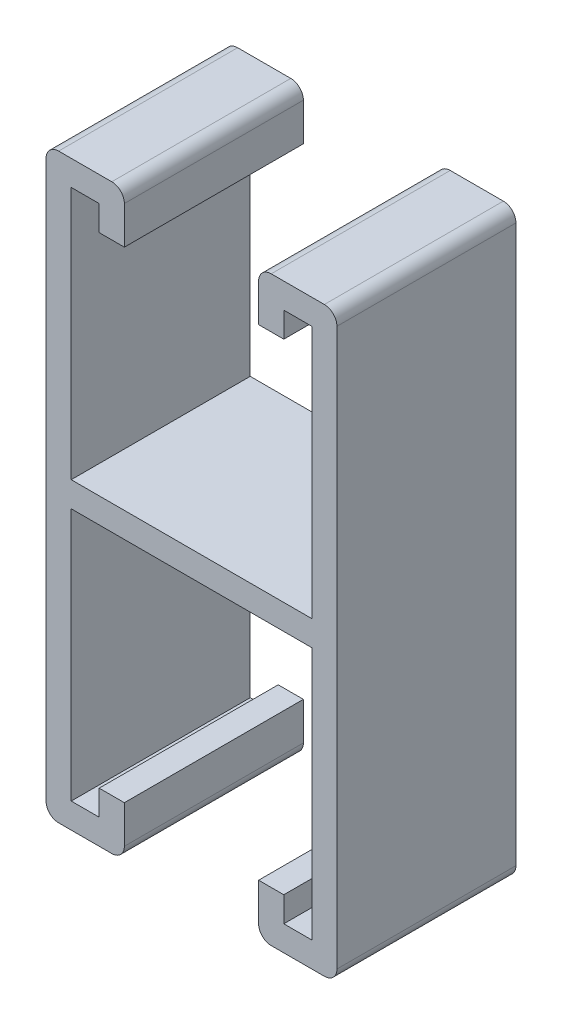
ISO-10303-21;
HEADER;
FILE_DESCRIPTION(('STEP AP214'),'2;1');
FILE_NAME('part.step','',(''),(''),'','','');
FILE_SCHEMA(('AUTOMOTIVE_DESIGN { 1 0 10303 214 1 1 1 1 }'));
ENDSEC;
DATA;
#1=APPLICATION_CONTEXT('core data for automotive mechanical design processes');
#2=APPLICATION_PROTOCOL_DEFINITION('international standard','automotive_design',2000,#1);
#3=PRODUCT_CONTEXT('',#1,'mechanical');
#4=PRODUCT('Part','Part','',(#3));
#5=PRODUCT_RELATED_PRODUCT_CATEGORY('part','',(#4));
#6=PRODUCT_DEFINITION_FORMATION('','',#4);
#7=PRODUCT_DEFINITION_CONTEXT('part definition',#1,'design');
#8=PRODUCT_DEFINITION('design','',#6,#7);
#9=PRODUCT_DEFINITION_SHAPE('','',#8);
#10=(LENGTH_UNIT() NAMED_UNIT(*) SI_UNIT(.MILLI.,.METRE.));
#11=(NAMED_UNIT(*) PLANE_ANGLE_UNIT() SI_UNIT($,.RADIAN.));
#12=(NAMED_UNIT(*) SI_UNIT($,.STERADIAN.) SOLID_ANGLE_UNIT());
#13=UNCERTAINTY_MEASURE_WITH_UNIT(LENGTH_MEASURE(1.E-05),#10,'distance_accuracy_value','');
#14=(GEOMETRIC_REPRESENTATION_CONTEXT(3) GLOBAL_UNCERTAINTY_ASSIGNED_CONTEXT((#13)) GLOBAL_UNIT_ASSIGNED_CONTEXT((#10,
#11,#12)) REPRESENTATION_CONTEXT('',''));
#15=CARTESIAN_POINT('',(0.,0.,0.));
#16=DIRECTION('',(0.,0.,1.));
#17=DIRECTION('',(1.,0.,0.));
#18=AXIS2_PLACEMENT_3D('',#15,#16,#17);
#19=CARTESIAN_POINT('',(9.525,34.13125,12.7));
#20=DIRECTION('',(0.,1.,0.));
#21=DIRECTION('',(0.,0.,1.));
#22=AXIS2_PLACEMENT_3D('',#19,#20,#21);
#23=PLANE('',#22);
#24=DIRECTION('',(1.,0.,0.));
#25=VECTOR('',#24,1.);
#26=CARTESIAN_POINT('',(9.525,34.13125,-12.7));
#27=LINE('',#26,#25);
#28=CARTESIAN_POINT('',(9.525,34.13125,-12.7));
#29=VERTEX_POINT('',#28);
#30=CARTESIAN_POINT('',(13.096875,34.13125,-12.7));
#31=VERTEX_POINT('',#30);
#32=EDGE_CURVE('E297',#29,#31,#27,.T.);
#33=ORIENTED_EDGE('',*,*,#32,.T.);
#34=DIRECTION('',(0.,0.,-1.));
#35=VECTOR('',#34,1.);
#36=CARTESIAN_POINT('',(13.096875,34.13125,12.7));
#37=LINE('',#36,#35);
#38=CARTESIAN_POINT('',(13.096875,34.13125,12.7));
#39=VERTEX_POINT('',#38);
#40=EDGE_CURVE('E11',#39,#31,#37,.T.);
#41=ORIENTED_EDGE('',*,*,#40,.F.);
#42=DIRECTION('',(1.,0.,0.));
#43=VECTOR('',#42,1.);
#44=CARTESIAN_POINT('',(9.525,34.13125,12.7));
#45=LINE('',#44,#43);
#46=CARTESIAN_POINT('',(9.525,34.13125,12.7));
#47=VERTEX_POINT('',#46);
#48=EDGE_CURVE('E367',#47,#39,#45,.T.);
#49=ORIENTED_EDGE('',*,*,#48,.F.);
#50=DIRECTION('',(0.,0.,-1.));
#51=VECTOR('',#50,1.);
#52=CARTESIAN_POINT('',(9.525,34.13125,12.7));
#53=LINE('',#52,#51);
#54=EDGE_CURVE('E293',#47,#29,#53,.T.);
#55=ORIENTED_EDGE('',*,*,#54,.T.);
#56=EDGE_LOOP('',(#33,#41,#49,#55));
#57=FACE_BOUND('',#56,.T.);
#58=ADVANCED_FACE('F33',(#57),#23,.F.);
#59=CARTESIAN_POINT('',(13.096875,37.703125,12.7));
#60=DIRECTION('',(-1.,0.,0.));
#61=DIRECTION('',(0.,0.,1.));
#62=AXIS2_PLACEMENT_3D('',#59,#60,#61);
#63=PLANE('',#62);
#64=DIRECTION('',(0.,1.,0.));
#65=VECTOR('',#64,1.);
#66=CARTESIAN_POINT('',(13.096875,37.703125,-12.7));
#67=LINE('',#66,#65);
#68=CARTESIAN_POINT('',(13.096875,37.703125,-12.7));
#69=VERTEX_POINT('',#68);
#70=EDGE_CURVE('E300',#31,#69,#67,.T.);
#71=ORIENTED_EDGE('',*,*,#70,.T.);
#72=DIRECTION('',(0.,0.,-1.));
#73=VECTOR('',#72,1.);
#74=CARTESIAN_POINT('',(13.096875,37.703125,12.7));
#75=LINE('',#74,#73);
#76=CARTESIAN_POINT('',(13.096875,37.703125,12.7));
#77=VERTEX_POINT('',#76);
#78=EDGE_CURVE('E41',#77,#69,#75,.T.);
#79=ORIENTED_EDGE('',*,*,#78,.F.);
#80=DIRECTION('',(0.,1.,0.));
#81=VECTOR('',#80,1.);
#82=CARTESIAN_POINT('',(13.096875,37.703125,12.7));
#83=LINE('',#82,#81);
#84=EDGE_CURVE('E176',#39,#77,#83,.T.);
#85=ORIENTED_EDGE('',*,*,#84,.F.);
#86=ORIENTED_EDGE('',*,*,#40,.T.);
#87=EDGE_LOOP('',(#71,#79,#85,#86));
#88=FACE_BOUND('',#87,.T.);
#89=ADVANCED_FACE('F565',(#88),#63,.F.);
#90=CARTESIAN_POINT('',(17.065625,37.703125,12.7));
#91=DIRECTION('',(0.,1.,0.));
#92=DIRECTION('',(0.,0.,1.));
#93=AXIS2_PLACEMENT_3D('',#90,#91,#92);
#94=PLANE('',#93);
#95=DIRECTION('',(1.,0.,0.));
#96=VECTOR('',#95,1.);
#97=CARTESIAN_POINT('',(17.065625,37.703125,-12.7));
#98=LINE('',#97,#96);
#99=CARTESIAN_POINT('',(17.065625,37.703125,-12.7));
#100=VERTEX_POINT('',#99);
#101=EDGE_CURVE('E302',#69,#100,#98,.T.);
#102=ORIENTED_EDGE('',*,*,#101,.T.);
#103=DIRECTION('',(0.,0.,-1.));
#104=VECTOR('',#103,1.);
#105=CARTESIAN_POINT('',(17.065625,37.703125,12.7));
#106=LINE('',#105,#104);
#107=CARTESIAN_POINT('',(17.065625,37.703125,12.7));
#108=VERTEX_POINT('',#107);
#109=EDGE_CURVE('E458',#108,#100,#106,.T.);
#110=ORIENTED_EDGE('',*,*,#109,.F.);
#111=DIRECTION('',(1.,0.,0.));
#112=VECTOR('',#111,1.);
#113=CARTESIAN_POINT('',(17.065625,37.703125,12.7));
#114=LINE('',#113,#112);
#115=EDGE_CURVE('E466',#77,#108,#114,.T.);
#116=ORIENTED_EDGE('',*,*,#115,.F.);
#117=ORIENTED_EDGE('',*,*,#78,.T.);
#118=EDGE_LOOP('',(#102,#110,#116,#117));
#119=FACE_BOUND('',#118,.T.);
#120=ADVANCED_FACE('F464',(#119),#94,.F.);
#121=CARTESIAN_POINT('',(17.065625,1.7859375,12.7));
#122=DIRECTION('',(1.,0.,0.));
#123=DIRECTION('',(0.,1.,0.));
#124=AXIS2_PLACEMENT_3D('',#121,#122,#123);
#125=PLANE('',#124);
#126=DIRECTION('',(0.,-1.,0.));
#127=VECTOR('',#126,1.);
#128=CARTESIAN_POINT('',(17.065625,1.7859375,-12.7));
#129=LINE('',#128,#127);
#130=CARTESIAN_POINT('',(17.065625,1.7859375,-12.7));
#131=VERTEX_POINT('',#130);
#132=EDGE_CURVE('E304',#100,#131,#129,.T.);
#133=ORIENTED_EDGE('',*,*,#132,.T.);
#134=DIRECTION('',(0.,0.,-1.));
#135=VECTOR('',#134,1.);
#136=CARTESIAN_POINT('',(17.065625,1.7859375,12.7));
#137=LINE('',#136,#135);
#138=CARTESIAN_POINT('',(17.065625,1.7859375,12.7));
#139=VERTEX_POINT('',#138);
#140=EDGE_CURVE('E455',#139,#131,#137,.T.);
#141=ORIENTED_EDGE('',*,*,#140,.F.);
#142=DIRECTION('',(0.,-1.,0.));
#143=VECTOR('',#142,1.);
#144=CARTESIAN_POINT('',(17.065625,1.7859375,12.7));
#145=LINE('',#144,#143);
#146=EDGE_CURVE('E484',#108,#139,#145,.T.);
#147=ORIENTED_EDGE('',*,*,#146,.F.);
#148=ORIENTED_EDGE('',*,*,#109,.T.);
#149=EDGE_LOOP('',(#133,#141,#147,#148));
#150=FACE_BOUND('',#149,.T.);
#151=ADVANCED_FACE('F475',(#150),#125,.F.);
#152=CARTESIAN_POINT('',(-17.065625,1.78593749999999,12.7));
#153=DIRECTION('',(0.,-1.,0.));
#154=DIRECTION('',(1.,0.,0.));
#155=AXIS2_PLACEMENT_3D('',#152,#153,#154);
#156=PLANE('',#155);
#157=DIRECTION('',(-1.,0.,0.));
#158=VECTOR('',#157,1.);
#159=CARTESIAN_POINT('',(-17.065625,1.78593749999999,-12.7));
#160=LINE('',#159,#158);
#161=CARTESIAN_POINT('',(-17.065625,1.78593749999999,-12.7));
#162=VERTEX_POINT('',#161);
#163=EDGE_CURVE('E306',#131,#162,#160,.T.);
#164=ORIENTED_EDGE('',*,*,#163,.T.);
#165=DIRECTION('',(0.,0.,-1.));
#166=VECTOR('',#165,1.);
#167=CARTESIAN_POINT('',(-17.065625,1.78593749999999,12.7));
#168=LINE('',#167,#166);
#169=CARTESIAN_POINT('',(-17.065625,1.78593749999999,12.7));
#170=VERTEX_POINT('',#169);
#171=EDGE_CURVE('E452',#170,#162,#168,.T.);
#172=ORIENTED_EDGE('',*,*,#171,.F.);
#173=DIRECTION('',(-1.,0.,0.));
#174=VECTOR('',#173,1.);
#175=CARTESIAN_POINT('',(-17.065625,1.78593749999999,12.7));
#176=LINE('',#175,#174);
#177=EDGE_CURVE('E481',#139,#170,#176,.T.);
#178=ORIENTED_EDGE('',*,*,#177,.F.);
#179=ORIENTED_EDGE('',*,*,#140,.T.);
#180=EDGE_LOOP('',(#164,#172,#178,#179));
#181=FACE_BOUND('',#180,.T.);
#182=ADVANCED_FACE('F479',(#181),#156,.F.);
#183=CARTESIAN_POINT('',(-17.065625,37.703125,12.7));
#184=DIRECTION('',(-1.,0.,0.));
#185=DIRECTION('',(0.,-1.,0.));
#186=AXIS2_PLACEMENT_3D('',#183,#184,#185);
#187=PLANE('',#186);
#188=DIRECTION('',(0.,1.,0.));
#189=VECTOR('',#188,1.);
#190=CARTESIAN_POINT('',(-17.065625,37.703125,-12.7));
#191=LINE('',#190,#189);
#192=CARTESIAN_POINT('',(-17.065625,37.703125,-12.7));
#193=VERTEX_POINT('',#192);
#194=EDGE_CURVE('E308',#162,#193,#191,.T.);
#195=ORIENTED_EDGE('',*,*,#194,.T.);
#196=DIRECTION('',(0.,0.,-1.));
#197=VECTOR('',#196,1.);
#198=CARTESIAN_POINT('',(-17.065625,37.703125,12.7));
#199=LINE('',#198,#197);
#200=CARTESIAN_POINT('',(-17.065625,37.703125,12.7));
#201=VERTEX_POINT('',#200);
#202=EDGE_CURVE('E449',#201,#193,#199,.T.);
#203=ORIENTED_EDGE('',*,*,#202,.F.);
#204=DIRECTION('',(0.,1.,0.));
#205=VECTOR('',#204,1.);
#206=CARTESIAN_POINT('',(-17.065625,37.703125,12.7));
#207=LINE('',#206,#205);
#208=EDGE_CURVE('E483',#170,#201,#207,.T.);
#209=ORIENTED_EDGE('',*,*,#208,.F.);
#210=ORIENTED_EDGE('',*,*,#171,.T.);
#211=EDGE_LOOP('',(#195,#203,#209,#210));
#212=FACE_BOUND('',#211,.T.);
#213=ADVANCED_FACE('F578',(#212),#187,.F.);
#214=CARTESIAN_POINT('',(-13.096875,37.703125,12.7));
#215=DIRECTION('',(0.,1.,0.));
#216=DIRECTION('',(0.,0.,1.));
#217=AXIS2_PLACEMENT_3D('',#214,#215,#216);
#218=PLANE('',#217);
#219=DIRECTION('',(1.,0.,0.));
#220=VECTOR('',#219,1.);
#221=CARTESIAN_POINT('',(-13.096875,37.703125,-12.7));
#222=LINE('',#221,#220);
#223=CARTESIAN_POINT('',(-13.096875,37.703125,-12.7));
#224=VERTEX_POINT('',#223);
#225=EDGE_CURVE('E310',#193,#224,#222,.T.);
#226=ORIENTED_EDGE('',*,*,#225,.T.);
#227=DIRECTION('',(0.,0.,-1.));
#228=VECTOR('',#227,1.);
#229=CARTESIAN_POINT('',(-13.096875,37.703125,12.7));
#230=LINE('',#229,#228);
#231=CARTESIAN_POINT('',(-13.096875,37.703125,12.7));
#232=VERTEX_POINT('',#231);
#233=EDGE_CURVE('E446',#232,#224,#230,.T.);
#234=ORIENTED_EDGE('',*,*,#233,.F.);
#235=DIRECTION('',(1.,0.,0.));
#236=VECTOR('',#235,1.);
#237=CARTESIAN_POINT('',(-13.096875,37.703125,12.7));
#238=LINE('',#237,#236);
#239=EDGE_CURVE('E486',#201,#232,#238,.T.);
#240=ORIENTED_EDGE('',*,*,#239,.F.);
#241=ORIENTED_EDGE('',*,*,#202,.T.);
#242=EDGE_LOOP('',(#226,#234,#240,#241));
#243=FACE_BOUND('',#242,.T.);
#244=ADVANCED_FACE('F581',(#243),#218,.F.);
#245=CARTESIAN_POINT('',(-13.096875,37.703125,12.7));
#246=DIRECTION('',(1.,0.,0.));
#247=DIRECTION('',(0.,0.,-1.));
#248=AXIS2_PLACEMENT_3D('',#245,#246,#247);
#249=PLANE('',#248);
#250=DIRECTION('',(0.,-1.,0.));
#251=VECTOR('',#250,1.);
#252=CARTESIAN_POINT('',(-13.096875,37.703125,-12.7));
#253=LINE('',#252,#251);
#254=CARTESIAN_POINT('',(-13.096875,34.13125,-12.7));
#255=VERTEX_POINT('',#254);
#256=EDGE_CURVE('E312',#224,#255,#253,.T.);
#257=ORIENTED_EDGE('',*,*,#256,.T.);
#258=DIRECTION('',(0.,0.,-1.));
#259=VECTOR('',#258,1.);
#260=CARTESIAN_POINT('',(-13.096875,34.13125,12.7));
#261=LINE('',#260,#259);
#262=CARTESIAN_POINT('',(-13.096875,34.13125,12.7));
#263=VERTEX_POINT('',#262);
#264=EDGE_CURVE('E443',#263,#255,#261,.T.);
#265=ORIENTED_EDGE('',*,*,#264,.F.);
#266=DIRECTION('',(0.,-1.,0.));
#267=VECTOR('',#266,1.);
#268=CARTESIAN_POINT('',(-13.096875,37.703125,12.7));
#269=LINE('',#268,#267);
#270=EDGE_CURVE('E492',#232,#263,#269,.T.);
#271=ORIENTED_EDGE('',*,*,#270,.F.);
#272=ORIENTED_EDGE('',*,*,#233,.T.);
#273=EDGE_LOOP('',(#257,#265,#271,#272));
#274=FACE_BOUND('',#273,.T.);
#275=ADVANCED_FACE('F585',(#274),#249,.F.);
#276=CARTESIAN_POINT('',(-13.096875,34.13125,12.7));
#277=DIRECTION('',(0.,1.,0.));
#278=DIRECTION('',(0.,0.,1.));
#279=AXIS2_PLACEMENT_3D('',#276,#277,#278);
#280=PLANE('',#279);
#281=DIRECTION('',(1.,0.,0.));
#282=VECTOR('',#281,1.);
#283=CARTESIAN_POINT('',(-13.096875,34.13125,-12.7));
#284=LINE('',#283,#282);
#285=CARTESIAN_POINT('',(-9.52500000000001,34.13125,-12.7));
#286=VERTEX_POINT('',#285);
#287=EDGE_CURVE('E314',#255,#286,#284,.T.);
#288=ORIENTED_EDGE('',*,*,#287,.T.);
#289=DIRECTION('',(0.,0.,-1.));
#290=VECTOR('',#289,1.);
#291=CARTESIAN_POINT('',(-9.52500000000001,34.13125,12.7));
#292=LINE('',#291,#290);
#293=CARTESIAN_POINT('',(-9.52500000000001,34.13125,12.7));
#294=VERTEX_POINT('',#293);
#295=EDGE_CURVE('E440',#294,#286,#292,.T.);
#296=ORIENTED_EDGE('',*,*,#295,.F.);
#297=DIRECTION('',(1.,0.,0.));
#298=VECTOR('',#297,1.);
#299=CARTESIAN_POINT('',(-13.096875,34.13125,12.7));
#300=LINE('',#299,#298);
#301=EDGE_CURVE('E494',#263,#294,#300,.T.);
#302=ORIENTED_EDGE('',*,*,#301,.F.);
#303=ORIENTED_EDGE('',*,*,#264,.T.);
#304=EDGE_LOOP('',(#288,#296,#302,#303));
#305=FACE_BOUND('',#304,.T.);
#306=ADVANCED_FACE('F589',(#305),#280,.F.);
#307=CARTESIAN_POINT('',(-9.52500000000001,39.4890625,12.7));
#308=DIRECTION('',(-1.,0.,0.));
#309=DIRECTION('',(0.,-1.,0.));
#310=AXIS2_PLACEMENT_3D('',#307,#308,#309);
#311=PLANE('',#310);
#312=DIRECTION('',(0.,1.,0.));
#313=VECTOR('',#312,1.);
#314=CARTESIAN_POINT('',(-9.52500000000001,39.4890625,-12.7));
#315=LINE('',#314,#313);
#316=CARTESIAN_POINT('',(-9.52500000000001,39.4890625,-12.7));
#317=VERTEX_POINT('',#316);
#318=EDGE_CURVE('E316',#286,#317,#315,.T.);
#319=ORIENTED_EDGE('',*,*,#318,.T.);
#320=DIRECTION('',(0.,0.,-1.));
#321=VECTOR('',#320,1.);
#322=CARTESIAN_POINT('',(-9.52500000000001,39.4890625,12.7));
#323=LINE('',#322,#321);
#324=CARTESIAN_POINT('',(-9.52500000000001,39.4890625,12.7));
#325=VERTEX_POINT('',#324);
#326=EDGE_CURVE('E437',#325,#317,#323,.T.);
#327=ORIENTED_EDGE('',*,*,#326,.F.);
#328=DIRECTION('',(0.,1.,0.));
#329=VECTOR('',#328,1.);
#330=CARTESIAN_POINT('',(-9.52500000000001,39.4890625,12.7));
#331=LINE('',#330,#329);
#332=EDGE_CURVE('E496',#294,#325,#331,.T.);
#333=ORIENTED_EDGE('',*,*,#332,.F.);
#334=ORIENTED_EDGE('',*,*,#295,.T.);
#335=EDGE_LOOP('',(#319,#327,#333,#334));
#336=FACE_BOUND('',#335,.T.);
#337=ADVANCED_FACE('F593',(#336),#311,.F.);
#338=CARTESIAN_POINT('',(-11.3109375,39.4890625,12.7));
#339=DIRECTION('',(0.,0.,-1.));
#340=DIRECTION('',(-1.,0.,0.));
#341=AXIS2_PLACEMENT_3D('',#338,#339,#340);
#342=CYLINDRICAL_SURFACE('',#341,1.7859375);
#343=CARTESIAN_POINT('',(-11.3109375,39.4890625,-12.7));
#344=DIRECTION('',(0.,0.,1.));
#345=DIRECTION('',(-1.,0.,0.));
#346=AXIS2_PLACEMENT_3D('',#343,#344,#345);
#347=CIRCLE('',#346,1.7859375);
#348=CARTESIAN_POINT('',(-11.3109375,41.275,-12.7));
#349=VERTEX_POINT('',#348);
#350=EDGE_CURVE('E318',#317,#349,#347,.T.);
#351=ORIENTED_EDGE('',*,*,#350,.T.);
#352=DIRECTION('',(0.,0.,-1.));
#353=VECTOR('',#352,1.);
#354=CARTESIAN_POINT('',(-11.3109375,41.275,12.7));
#355=LINE('',#354,#353);
#356=CARTESIAN_POINT('',(-11.3109375,41.275,12.7));
#357=VERTEX_POINT('',#356);
#358=EDGE_CURVE('E434',#357,#349,#355,.T.);
#359=ORIENTED_EDGE('',*,*,#358,.F.);
#360=CARTESIAN_POINT('',(-11.3109375,39.4890625,12.7));
#361=DIRECTION('',(0.,0.,1.));
#362=DIRECTION('',(-1.,0.,0.));
#363=AXIS2_PLACEMENT_3D('',#360,#361,#362);
#364=CIRCLE('',#363,1.7859375);
#365=EDGE_CURVE('E498',#325,#357,#364,.T.);
#366=ORIENTED_EDGE('',*,*,#365,.F.);
#367=ORIENTED_EDGE('',*,*,#326,.T.);
#368=EDGE_LOOP('',(#351,#359,#366,#367));
#369=FACE_BOUND('',#368,.T.);
#370=ADVANCED_FACE('F597',(#369),#342,.T.);
#371=CARTESIAN_POINT('',(-11.3109375,41.275,12.7));
#372=DIRECTION('',(0.,-1.,0.));
#373=DIRECTION('',(1.,0.,0.));
#374=AXIS2_PLACEMENT_3D('',#371,#372,#373);
#375=PLANE('',#374);
#376=DIRECTION('',(-1.,0.,0.));
#377=VECTOR('',#376,1.);
#378=CARTESIAN_POINT('',(-11.3109375,41.275,-12.7));
#379=LINE('',#378,#377);
#380=CARTESIAN_POINT('',(-18.8515625,41.275,-12.7));
#381=VERTEX_POINT('',#380);
#382=EDGE_CURVE('E320',#349,#381,#379,.T.);
#383=ORIENTED_EDGE('',*,*,#382,.T.);
#384=DIRECTION('',(0.,0.,-1.));
#385=VECTOR('',#384,1.);
#386=CARTESIAN_POINT('',(-18.8515625,41.275,12.7));
#387=LINE('',#386,#385);
#388=CARTESIAN_POINT('',(-18.8515625,41.275,12.7));
#389=VERTEX_POINT('',#388);
#390=EDGE_CURVE('E431',#389,#381,#387,.T.);
#391=ORIENTED_EDGE('',*,*,#390,.F.);
#392=DIRECTION('',(-1.,0.,0.));
#393=VECTOR('',#392,1.);
#394=CARTESIAN_POINT('',(-11.3109375,41.275,12.7));
#395=LINE('',#394,#393);
#396=EDGE_CURVE('E500',#357,#389,#395,.T.);
#397=ORIENTED_EDGE('',*,*,#396,.F.);
#398=ORIENTED_EDGE('',*,*,#358,.T.);
#399=EDGE_LOOP('',(#383,#391,#397,#398));
#400=FACE_BOUND('',#399,.T.);
#401=ADVANCED_FACE('F601',(#400),#375,.F.);
#402=CARTESIAN_POINT('',(-18.8515625,39.4890625,12.7));
#403=DIRECTION('',(0.,0.,-1.));
#404=DIRECTION('',(-1.,0.,0.));
#405=AXIS2_PLACEMENT_3D('',#402,#403,#404);
#406=CYLINDRICAL_SURFACE('',#405,1.78593750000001);
#407=CARTESIAN_POINT('',(-18.8515625,39.4890625,-12.7));
#408=DIRECTION('',(0.,0.,1.));
#409=DIRECTION('',(-1.,0.,0.));
#410=AXIS2_PLACEMENT_3D('',#407,#408,#409);
#411=CIRCLE('',#410,1.78593750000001);
#412=CARTESIAN_POINT('',(-20.6375,39.4890625,-12.7));
#413=VERTEX_POINT('',#412);
#414=EDGE_CURVE('E322',#381,#413,#411,.T.);
#415=ORIENTED_EDGE('',*,*,#414,.T.);
#416=DIRECTION('',(0.,0.,-1.));
#417=VECTOR('',#416,1.);
#418=CARTESIAN_POINT('',(-20.6375,39.4890625,12.7));
#419=LINE('',#418,#417);
#420=CARTESIAN_POINT('',(-20.6375,39.4890625,12.7));
#421=VERTEX_POINT('',#420);
#422=EDGE_CURVE('E428',#421,#413,#419,.T.);
#423=ORIENTED_EDGE('',*,*,#422,.F.);
#424=CARTESIAN_POINT('',(-18.8515625,39.4890625,12.7));
#425=DIRECTION('',(0.,0.,1.));
#426=DIRECTION('',(-1.,0.,0.));
#427=AXIS2_PLACEMENT_3D('',#424,#425,#426);
#428=CIRCLE('',#427,1.78593750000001);
#429=EDGE_CURVE('E502',#389,#421,#428,.T.);
#430=ORIENTED_EDGE('',*,*,#429,.F.);
#431=ORIENTED_EDGE('',*,*,#390,.T.);
#432=EDGE_LOOP('',(#415,#423,#430,#431));
#433=FACE_BOUND('',#432,.T.);
#434=ADVANCED_FACE('F605',(#433),#406,.T.);
#435=CARTESIAN_POINT('',(-20.6375,39.4890625,12.7));
#436=DIRECTION('',(1.,0.,0.));
#437=DIRECTION('',(0.,1.,0.));
#438=AXIS2_PLACEMENT_3D('',#435,#436,#437);
#439=PLANE('',#438);
#440=DIRECTION('',(0.,-1.,0.));
#441=VECTOR('',#440,1.);
#442=CARTESIAN_POINT('',(-20.6375,39.4890625,-12.7));
#443=LINE('',#442,#441);
#444=CARTESIAN_POINT('',(-20.6375,-39.4890625,-12.7));
#445=VERTEX_POINT('',#444);
#446=EDGE_CURVE('E324',#413,#445,#443,.T.);
#447=ORIENTED_EDGE('',*,*,#446,.T.);
#448=DIRECTION('',(0.,0.,-1.));
#449=VECTOR('',#448,1.);
#450=CARTESIAN_POINT('',(-20.6375,-39.4890625,12.7));
#451=LINE('',#450,#449);
#452=CARTESIAN_POINT('',(-20.6375,-39.4890625,12.7));
#453=VERTEX_POINT('',#452);
#454=EDGE_CURVE('E425',#453,#445,#451,.T.);
#455=ORIENTED_EDGE('',*,*,#454,.F.);
#456=DIRECTION('',(0.,-1.,0.));
#457=VECTOR('',#456,1.);
#458=CARTESIAN_POINT('',(-20.6375,39.4890625,12.7));
#459=LINE('',#458,#457);
#460=EDGE_CURVE('E504',#421,#453,#459,.T.);
#461=ORIENTED_EDGE('',*,*,#460,.F.);
#462=ORIENTED_EDGE('',*,*,#422,.T.);
#463=EDGE_LOOP('',(#447,#455,#461,#462));
#464=FACE_BOUND('',#463,.T.);
#465=ADVANCED_FACE('F609',(#464),#439,.F.);
#466=CARTESIAN_POINT('',(-18.8515625,-39.4890625,12.7));
#467=DIRECTION('',(0.,0.,-1.));
#468=DIRECTION('',(-1.,0.,0.));
#469=AXIS2_PLACEMENT_3D('',#466,#467,#468);
#470=CYLINDRICAL_SURFACE('',#469,1.78593750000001);
#471=CARTESIAN_POINT('',(-18.8515625,-39.4890625,-12.7));
#472=DIRECTION('',(0.,0.,1.));
#473=DIRECTION('',(1.,0.,0.));
#474=AXIS2_PLACEMENT_3D('',#471,#472,#473);
#475=CIRCLE('',#474,1.78593750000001);
#476=CARTESIAN_POINT('',(-18.8515625,-41.275,-12.7));
#477=VERTEX_POINT('',#476);
#478=EDGE_CURVE('E326',#445,#477,#475,.T.);
#479=ORIENTED_EDGE('',*,*,#478,.T.);
#480=DIRECTION('',(0.,0.,-1.));
#481=VECTOR('',#480,1.);
#482=CARTESIAN_POINT('',(-18.8515625,-41.275,12.7));
#483=LINE('',#482,#481);
#484=CARTESIAN_POINT('',(-18.8515625,-41.275,12.7));
#485=VERTEX_POINT('',#484);
#486=EDGE_CURVE('E422',#485,#477,#483,.T.);
#487=ORIENTED_EDGE('',*,*,#486,.F.);
#488=CARTESIAN_POINT('',(-18.8515625,-39.4890625,12.7));
#489=DIRECTION('',(0.,0.,1.));
#490=DIRECTION('',(1.,0.,0.));
#491=AXIS2_PLACEMENT_3D('',#488,#489,#490);
#492=CIRCLE('',#491,1.78593750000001);
#493=EDGE_CURVE('E506',#453,#485,#492,.T.);
#494=ORIENTED_EDGE('',*,*,#493,.F.);
#495=ORIENTED_EDGE('',*,*,#454,.T.);
#496=EDGE_LOOP('',(#479,#487,#494,#495));
#497=FACE_BOUND('',#496,.T.);
#498=ADVANCED_FACE('F613',(#497),#470,.T.);
#499=CARTESIAN_POINT('',(-11.3109375,-41.275,12.7));
#500=DIRECTION('',(0.,1.,0.));
#501=DIRECTION('',(-1.,0.,0.));
#502=AXIS2_PLACEMENT_3D('',#499,#500,#501);
#503=PLANE('',#502);
#504=DIRECTION('',(1.,0.,0.));
#505=VECTOR('',#504,1.);
#506=CARTESIAN_POINT('',(-11.3109375,-41.275,-12.7));
#507=LINE('',#506,#505);
#508=CARTESIAN_POINT('',(-11.3109375,-41.275,-12.7));
#509=VERTEX_POINT('',#508);
#510=EDGE_CURVE('E328',#477,#509,#507,.T.);
#511=ORIENTED_EDGE('',*,*,#510,.T.);
#512=DIRECTION('',(0.,0.,-1.));
#513=VECTOR('',#512,1.);
#514=CARTESIAN_POINT('',(-11.3109375,-41.275,12.7));
#515=LINE('',#514,#513);
#516=CARTESIAN_POINT('',(-11.3109375,-41.275,12.7));
#517=VERTEX_POINT('',#516);
#518=EDGE_CURVE('E419',#517,#509,#515,.T.);
#519=ORIENTED_EDGE('',*,*,#518,.F.);
#520=DIRECTION('',(1.,0.,0.));
#521=VECTOR('',#520,1.);
#522=CARTESIAN_POINT('',(-11.3109375,-41.275,12.7));
#523=LINE('',#522,#521);
#524=EDGE_CURVE('E508',#485,#517,#523,.T.);
#525=ORIENTED_EDGE('',*,*,#524,.F.);
#526=ORIENTED_EDGE('',*,*,#486,.T.);
#527=EDGE_LOOP('',(#511,#519,#525,#526));
#528=FACE_BOUND('',#527,.T.);
#529=ADVANCED_FACE('F617',(#528),#503,.F.);
#530=CARTESIAN_POINT('',(-11.3109375,-39.4890625,12.7));
#531=DIRECTION('',(0.,0.,-1.));
#532=DIRECTION('',(-1.,0.,0.));
#533=AXIS2_PLACEMENT_3D('',#530,#531,#532);
#534=CYLINDRICAL_SURFACE('',#533,1.7859375);
#535=CARTESIAN_POINT('',(-11.3109375,-39.4890625,-12.7));
#536=DIRECTION('',(0.,0.,1.));
#537=DIRECTION('',(1.,0.,0.));
#538=AXIS2_PLACEMENT_3D('',#535,#536,#537);
#539=CIRCLE('',#538,1.7859375);
#540=CARTESIAN_POINT('',(-9.525,-39.4890625,-12.7));
#541=VERTEX_POINT('',#540);
#542=EDGE_CURVE('E330',#509,#541,#539,.T.);
#543=ORIENTED_EDGE('',*,*,#542,.T.);
#544=DIRECTION('',(0.,0.,-1.));
#545=VECTOR('',#544,1.);
#546=CARTESIAN_POINT('',(-9.525,-39.4890625,12.7));
#547=LINE('',#546,#545);
#548=CARTESIAN_POINT('',(-9.525,-39.4890625,12.7));
#549=VERTEX_POINT('',#548);
#550=EDGE_CURVE('E416',#549,#541,#547,.T.);
#551=ORIENTED_EDGE('',*,*,#550,.F.);
#552=CARTESIAN_POINT('',(-11.3109375,-39.4890625,12.7));
#553=DIRECTION('',(0.,0.,1.));
#554=DIRECTION('',(1.,0.,0.));
#555=AXIS2_PLACEMENT_3D('',#552,#553,#554);
#556=CIRCLE('',#555,1.7859375);
#557=EDGE_CURVE('E510',#517,#549,#556,.T.);
#558=ORIENTED_EDGE('',*,*,#557,.F.);
#559=ORIENTED_EDGE('',*,*,#518,.T.);
#560=EDGE_LOOP('',(#543,#551,#558,#559));
#561=FACE_BOUND('',#560,.T.);
#562=ADVANCED_FACE('F621',(#561),#534,.T.);
#563=CARTESIAN_POINT('',(-9.525,-39.4890625,12.7));
#564=DIRECTION('',(-1.,0.,0.));
#565=DIRECTION('',(0.,-1.,0.));
#566=AXIS2_PLACEMENT_3D('',#563,#564,#565);
#567=PLANE('',#566);
#568=DIRECTION('',(0.,1.,0.));
#569=VECTOR('',#568,1.);
#570=CARTESIAN_POINT('',(-9.525,-39.4890625,-12.7));
#571=LINE('',#570,#569);
#572=CARTESIAN_POINT('',(-9.525,-34.13125,-12.7));
#573=VERTEX_POINT('',#572);
#574=EDGE_CURVE('E332',#541,#573,#571,.T.);
#575=ORIENTED_EDGE('',*,*,#574,.T.);
#576=DIRECTION('',(0.,0.,-1.));
#577=VECTOR('',#576,1.);
#578=CARTESIAN_POINT('',(-9.525,-34.13125,12.7));
#579=LINE('',#578,#577);
#580=CARTESIAN_POINT('',(-9.525,-34.13125,12.7));
#581=VERTEX_POINT('',#580);
#582=EDGE_CURVE('E413',#581,#573,#579,.T.);
#583=ORIENTED_EDGE('',*,*,#582,.F.);
#584=DIRECTION('',(0.,1.,0.));
#585=VECTOR('',#584,1.);
#586=CARTESIAN_POINT('',(-9.525,-39.4890625,12.7));
#587=LINE('',#586,#585);
#588=EDGE_CURVE('E512',#549,#581,#587,.T.);
#589=ORIENTED_EDGE('',*,*,#588,.F.);
#590=ORIENTED_EDGE('',*,*,#550,.T.);
#591=EDGE_LOOP('',(#575,#583,#589,#590));
#592=FACE_BOUND('',#591,.T.);
#593=ADVANCED_FACE('F625',(#592),#567,.F.);
#594=CARTESIAN_POINT('',(-13.096875,-34.13125,12.7));
#595=DIRECTION('',(0.,-1.,0.));
#596=DIRECTION('',(0.,0.,-1.));
#597=AXIS2_PLACEMENT_3D('',#594,#595,#596);
#598=PLANE('',#597);
#599=DIRECTION('',(-1.,0.,0.));
#600=VECTOR('',#599,1.);
#601=CARTESIAN_POINT('',(-13.096875,-34.13125,-12.7));
#602=LINE('',#601,#600);
#603=CARTESIAN_POINT('',(-13.096875,-34.13125,-12.7));
#604=VERTEX_POINT('',#603);
#605=EDGE_CURVE('E334',#573,#604,#602,.T.);
#606=ORIENTED_EDGE('',*,*,#605,.T.);
#607=DIRECTION('',(0.,0.,-1.));
#608=VECTOR('',#607,1.);
#609=CARTESIAN_POINT('',(-13.096875,-34.13125,12.7));
#610=LINE('',#609,#608);
#611=CARTESIAN_POINT('',(-13.096875,-34.13125,12.7));
#612=VERTEX_POINT('',#611);
#613=EDGE_CURVE('E410',#612,#604,#610,.T.);
#614=ORIENTED_EDGE('',*,*,#613,.F.);
#615=DIRECTION('',(-1.,0.,0.));
#616=VECTOR('',#615,1.);
#617=CARTESIAN_POINT('',(-13.096875,-34.13125,12.7));
#618=LINE('',#617,#616);
#619=EDGE_CURVE('E514',#581,#612,#618,.T.);
#620=ORIENTED_EDGE('',*,*,#619,.F.);
#621=ORIENTED_EDGE('',*,*,#582,.T.);
#622=EDGE_LOOP('',(#606,#614,#620,#621));
#623=FACE_BOUND('',#622,.T.);
#624=ADVANCED_FACE('F629',(#623),#598,.F.);
#625=CARTESIAN_POINT('',(-13.096875,-37.703125,12.7));
#626=DIRECTION('',(1.,0.,0.));
#627=DIRECTION('',(0.,0.,-1.));
#628=AXIS2_PLACEMENT_3D('',#625,#626,#627);
#629=PLANE('',#628);
#630=DIRECTION('',(0.,-1.,0.));
#631=VECTOR('',#630,1.);
#632=CARTESIAN_POINT('',(-13.096875,-37.703125,-12.7));
#633=LINE('',#632,#631);
#634=CARTESIAN_POINT('',(-13.096875,-37.703125,-12.7));
#635=VERTEX_POINT('',#634);
#636=EDGE_CURVE('E336',#604,#635,#633,.T.);
#637=ORIENTED_EDGE('',*,*,#636,.T.);
#638=DIRECTION('',(0.,0.,-1.));
#639=VECTOR('',#638,1.);
#640=CARTESIAN_POINT('',(-13.096875,-37.703125,12.7));
#641=LINE('',#640,#639);
#642=CARTESIAN_POINT('',(-13.096875,-37.703125,12.7));
#643=VERTEX_POINT('',#642);
#644=EDGE_CURVE('E407',#643,#635,#641,.T.);
#645=ORIENTED_EDGE('',*,*,#644,.F.);
#646=DIRECTION('',(0.,-1.,0.));
#647=VECTOR('',#646,1.);
#648=CARTESIAN_POINT('',(-13.096875,-37.703125,12.7));
#649=LINE('',#648,#647);
#650=EDGE_CURVE('E516',#612,#643,#649,.T.);
#651=ORIENTED_EDGE('',*,*,#650,.F.);
#652=ORIENTED_EDGE('',*,*,#613,.T.);
#653=EDGE_LOOP('',(#637,#645,#651,#652));
#654=FACE_BOUND('',#653,.T.);
#655=ADVANCED_FACE('F633',(#654),#629,.F.);
#656=CARTESIAN_POINT('',(-13.096875,-37.703125,12.7));
#657=DIRECTION('',(0.,-1.,0.));
#658=DIRECTION('',(0.,0.,-1.));
#659=AXIS2_PLACEMENT_3D('',#656,#657,#658);
#660=PLANE('',#659);
#661=DIRECTION('',(-1.,0.,0.));
#662=VECTOR('',#661,1.);
#663=CARTESIAN_POINT('',(-13.096875,-37.703125,-12.7));
#664=LINE('',#663,#662);
#665=CARTESIAN_POINT('',(-17.065625,-37.703125,-12.7));
#666=VERTEX_POINT('',#665);
#667=EDGE_CURVE('E338',#635,#666,#664,.T.);
#668=ORIENTED_EDGE('',*,*,#667,.T.);
#669=DIRECTION('',(0.,0.,-1.));
#670=VECTOR('',#669,1.);
#671=CARTESIAN_POINT('',(-17.065625,-37.703125,12.7));
#672=LINE('',#671,#670);
#673=CARTESIAN_POINT('',(-17.065625,-37.703125,12.7));
#674=VERTEX_POINT('',#673);
#675=EDGE_CURVE('E404',#674,#666,#672,.T.);
#676=ORIENTED_EDGE('',*,*,#675,.F.);
#677=DIRECTION('',(-1.,0.,0.));
#678=VECTOR('',#677,1.);
#679=CARTESIAN_POINT('',(-13.096875,-37.703125,12.7));
#680=LINE('',#679,#678);
#681=EDGE_CURVE('E518',#643,#674,#680,.T.);
#682=ORIENTED_EDGE('',*,*,#681,.F.);
#683=ORIENTED_EDGE('',*,*,#644,.T.);
#684=EDGE_LOOP('',(#668,#676,#682,#683));
#685=FACE_BOUND('',#684,.T.);
#686=ADVANCED_FACE('F637',(#685),#660,.F.);
#687=CARTESIAN_POINT('',(-17.065625,-37.703125,12.7));
#688=DIRECTION('',(-1.,0.,0.));
#689=DIRECTION('',(0.,-1.,0.));
#690=AXIS2_PLACEMENT_3D('',#687,#688,#689);
#691=PLANE('',#690);
#692=DIRECTION('',(0.,1.,0.));
#693=VECTOR('',#692,1.);
#694=CARTESIAN_POINT('',(-17.065625,-37.703125,-12.7));
#695=LINE('',#694,#693);
#696=CARTESIAN_POINT('',(-17.065625,-1.7859375,-12.7));
#697=VERTEX_POINT('',#696);
#698=EDGE_CURVE('E340',#666,#697,#695,.T.);
#699=ORIENTED_EDGE('',*,*,#698,.T.);
#700=DIRECTION('',(0.,0.,-1.));
#701=VECTOR('',#700,1.);
#702=CARTESIAN_POINT('',(-17.065625,-1.7859375,12.7));
#703=LINE('',#702,#701);
#704=CARTESIAN_POINT('',(-17.065625,-1.7859375,12.7));
#705=VERTEX_POINT('',#704);
#706=EDGE_CURVE('E401',#705,#697,#703,.T.);
#707=ORIENTED_EDGE('',*,*,#706,.F.);
#708=DIRECTION('',(0.,1.,0.));
#709=VECTOR('',#708,1.);
#710=CARTESIAN_POINT('',(-17.065625,-37.703125,12.7));
#711=LINE('',#710,#709);
#712=EDGE_CURVE('E520',#674,#705,#711,.T.);
#713=ORIENTED_EDGE('',*,*,#712,.F.);
#714=ORIENTED_EDGE('',*,*,#675,.T.);
#715=EDGE_LOOP('',(#699,#707,#713,#714));
#716=FACE_BOUND('',#715,.T.);
#717=ADVANCED_FACE('F641',(#716),#691,.F.);
#718=CARTESIAN_POINT('',(-17.065625,-1.7859375,12.7));
#719=DIRECTION('',(0.,1.,0.));
#720=DIRECTION('',(0.,0.,1.));
#721=AXIS2_PLACEMENT_3D('',#718,#719,#720);
#722=PLANE('',#721);
#723=DIRECTION('',(1.,0.,0.));
#724=VECTOR('',#723,1.);
#725=CARTESIAN_POINT('',(-17.065625,-1.7859375,-12.7));
#726=LINE('',#725,#724);
#727=CARTESIAN_POINT('',(17.065625,-1.7859375,-12.7));
#728=VERTEX_POINT('',#727);
#729=EDGE_CURVE('E342',#697,#728,#726,.T.);
#730=ORIENTED_EDGE('',*,*,#729,.T.);
#731=DIRECTION('',(0.,0.,-1.));
#732=VECTOR('',#731,1.);
#733=CARTESIAN_POINT('',(17.065625,-1.7859375,12.7));
#734=LINE('',#733,#732);
#735=CARTESIAN_POINT('',(17.065625,-1.7859375,12.7));
#736=VERTEX_POINT('',#735);
#737=EDGE_CURVE('E398',#736,#728,#734,.T.);
#738=ORIENTED_EDGE('',*,*,#737,.F.);
#739=DIRECTION('',(1.,0.,0.));
#740=VECTOR('',#739,1.);
#741=CARTESIAN_POINT('',(-17.065625,-1.7859375,12.7));
#742=LINE('',#741,#740);
#743=EDGE_CURVE('E522',#705,#736,#742,.T.);
#744=ORIENTED_EDGE('',*,*,#743,.F.);
#745=ORIENTED_EDGE('',*,*,#706,.T.);
#746=EDGE_LOOP('',(#730,#738,#744,#745));
#747=FACE_BOUND('',#746,.T.);
#748=ADVANCED_FACE('F645',(#747),#722,.F.);
#749=CARTESIAN_POINT('',(17.065625,-1.7859375,12.7));
#750=DIRECTION('',(1.,0.,0.));
#751=DIRECTION('',(0.,1.,0.));
#752=AXIS2_PLACEMENT_3D('',#749,#750,#751);
#753=PLANE('',#752);
#754=DIRECTION('',(0.,-1.,0.));
#755=VECTOR('',#754,1.);
#756=CARTESIAN_POINT('',(17.065625,-1.7859375,-12.7));
#757=LINE('',#756,#755);
#758=CARTESIAN_POINT('',(17.065625,-37.703125,-12.7));
#759=VERTEX_POINT('',#758);
#760=EDGE_CURVE('E344',#728,#759,#757,.T.);
#761=ORIENTED_EDGE('',*,*,#760,.T.);
#762=DIRECTION('',(0.,0.,-1.));
#763=VECTOR('',#762,1.);
#764=CARTESIAN_POINT('',(17.065625,-37.703125,12.7));
#765=LINE('',#764,#763);
#766=CARTESIAN_POINT('',(17.065625,-37.703125,12.7));
#767=VERTEX_POINT('',#766);
#768=EDGE_CURVE('E395',#767,#759,#765,.T.);
#769=ORIENTED_EDGE('',*,*,#768,.F.);
#770=DIRECTION('',(0.,-1.,0.));
#771=VECTOR('',#770,1.);
#772=CARTESIAN_POINT('',(17.065625,-1.7859375,12.7));
#773=LINE('',#772,#771);
#774=EDGE_CURVE('E524',#736,#767,#773,.T.);
#775=ORIENTED_EDGE('',*,*,#774,.F.);
#776=ORIENTED_EDGE('',*,*,#737,.T.);
#777=EDGE_LOOP('',(#761,#769,#775,#776));
#778=FACE_BOUND('',#777,.T.);
#779=ADVANCED_FACE('F649',(#778),#753,.F.);
#780=CARTESIAN_POINT('',(17.065625,-37.703125,12.7));
#781=DIRECTION('',(0.,-1.,0.));
#782=DIRECTION('',(0.,0.,-1.));
#783=AXIS2_PLACEMENT_3D('',#780,#781,#782);
#784=PLANE('',#783);
#785=DIRECTION('',(-1.,0.,0.));
#786=VECTOR('',#785,1.);
#787=CARTESIAN_POINT('',(17.065625,-37.703125,-12.7));
#788=LINE('',#787,#786);
#789=CARTESIAN_POINT('',(13.096875,-37.703125,-12.7));
#790=VERTEX_POINT('',#789);
#791=EDGE_CURVE('E346',#759,#790,#788,.T.);
#792=ORIENTED_EDGE('',*,*,#791,.T.);
#793=DIRECTION('',(0.,0.,-1.));
#794=VECTOR('',#793,1.);
#795=CARTESIAN_POINT('',(13.096875,-37.703125,12.7));
#796=LINE('',#795,#794);
#797=CARTESIAN_POINT('',(13.096875,-37.703125,12.7));
#798=VERTEX_POINT('',#797);
#799=EDGE_CURVE('E392',#798,#790,#796,.T.);
#800=ORIENTED_EDGE('',*,*,#799,.F.);
#801=DIRECTION('',(-1.,0.,0.));
#802=VECTOR('',#801,1.);
#803=CARTESIAN_POINT('',(17.065625,-37.703125,12.7));
#804=LINE('',#803,#802);
#805=EDGE_CURVE('E526',#767,#798,#804,.T.);
#806=ORIENTED_EDGE('',*,*,#805,.F.);
#807=ORIENTED_EDGE('',*,*,#768,.T.);
#808=EDGE_LOOP('',(#792,#800,#806,#807));
#809=FACE_BOUND('',#808,.T.);
#810=ADVANCED_FACE('F653',(#809),#784,.F.);
#811=CARTESIAN_POINT('',(13.096875,-37.703125,12.7));
#812=DIRECTION('',(-1.,0.,0.));
#813=DIRECTION('',(0.,0.,1.));
#814=AXIS2_PLACEMENT_3D('',#811,#812,#813);
#815=PLANE('',#814);
#816=DIRECTION('',(0.,1.,0.));
#817=VECTOR('',#816,1.);
#818=CARTESIAN_POINT('',(13.096875,-37.703125,-12.7));
#819=LINE('',#818,#817);
#820=CARTESIAN_POINT('',(13.096875,-34.13125,-12.7));
#821=VERTEX_POINT('',#820);
#822=EDGE_CURVE('E348',#790,#821,#819,.T.);
#823=ORIENTED_EDGE('',*,*,#822,.T.);
#824=DIRECTION('',(0.,0.,-1.));
#825=VECTOR('',#824,1.);
#826=CARTESIAN_POINT('',(13.096875,-34.13125,12.7));
#827=LINE('',#826,#825);
#828=CARTESIAN_POINT('',(13.096875,-34.13125,12.7));
#829=VERTEX_POINT('',#828);
#830=EDGE_CURVE('E389',#829,#821,#827,.T.);
#831=ORIENTED_EDGE('',*,*,#830,.F.);
#832=DIRECTION('',(0.,1.,0.));
#833=VECTOR('',#832,1.);
#834=CARTESIAN_POINT('',(13.096875,-37.703125,12.7));
#835=LINE('',#834,#833);
#836=EDGE_CURVE('E528',#798,#829,#835,.T.);
#837=ORIENTED_EDGE('',*,*,#836,.F.);
#838=ORIENTED_EDGE('',*,*,#799,.T.);
#839=EDGE_LOOP('',(#823,#831,#837,#838));
#840=FACE_BOUND('',#839,.T.);
#841=ADVANCED_FACE('F657',(#840),#815,.F.);
#842=CARTESIAN_POINT('',(9.525,-34.13125,12.7));
#843=DIRECTION('',(0.,-1.,0.));
#844=DIRECTION('',(0.,0.,-1.));
#845=AXIS2_PLACEMENT_3D('',#842,#843,#844);
#846=PLANE('',#845);
#847=DIRECTION('',(-1.,0.,0.));
#848=VECTOR('',#847,1.);
#849=CARTESIAN_POINT('',(9.525,-34.13125,-12.7));
#850=LINE('',#849,#848);
#851=CARTESIAN_POINT('',(9.525,-34.13125,-12.7));
#852=VERTEX_POINT('',#851);
#853=EDGE_CURVE('E350',#821,#852,#850,.T.);
#854=ORIENTED_EDGE('',*,*,#853,.T.);
#855=DIRECTION('',(0.,0.,-1.));
#856=VECTOR('',#855,1.);
#857=CARTESIAN_POINT('',(9.525,-34.13125,12.7));
#858=LINE('',#857,#856);
#859=CARTESIAN_POINT('',(9.525,-34.13125,12.7));
#860=VERTEX_POINT('',#859);
#861=EDGE_CURVE('E386',#860,#852,#858,.T.);
#862=ORIENTED_EDGE('',*,*,#861,.F.);
#863=DIRECTION('',(-1.,0.,0.));
#864=VECTOR('',#863,1.);
#865=CARTESIAN_POINT('',(9.525,-34.13125,12.7));
#866=LINE('',#865,#864);
#867=EDGE_CURVE('E530',#829,#860,#866,.T.);
#868=ORIENTED_EDGE('',*,*,#867,.F.);
#869=ORIENTED_EDGE('',*,*,#830,.T.);
#870=EDGE_LOOP('',(#854,#862,#868,#869));
#871=FACE_BOUND('',#870,.T.);
#872=ADVANCED_FACE('F661',(#871),#846,.F.);
#873=CARTESIAN_POINT('',(9.52500000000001,-39.4890625,12.7));
#874=DIRECTION('',(1.,0.,0.));
#875=DIRECTION('',(0.,1.,0.));
#876=AXIS2_PLACEMENT_3D('',#873,#874,#875);
#877=PLANE('',#876);
#878=DIRECTION('',(0.,-1.,0.));
#879=VECTOR('',#878,1.);
#880=CARTESIAN_POINT('',(9.52500000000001,-39.4890625,-12.7));
#881=LINE('',#880,#879);
#882=CARTESIAN_POINT('',(9.52500000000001,-39.4890625,-12.7));
#883=VERTEX_POINT('',#882);
#884=EDGE_CURVE('E352',#852,#883,#881,.T.);
#885=ORIENTED_EDGE('',*,*,#884,.T.);
#886=DIRECTION('',(0.,0.,-1.));
#887=VECTOR('',#886,1.);
#888=CARTESIAN_POINT('',(9.52500000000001,-39.4890625,12.7));
#889=LINE('',#888,#887);
#890=CARTESIAN_POINT('',(9.52500000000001,-39.4890625,12.7));
#891=VERTEX_POINT('',#890);
#892=EDGE_CURVE('E383',#891,#883,#889,.T.);
#893=ORIENTED_EDGE('',*,*,#892,.F.);
#894=DIRECTION('',(0.,-1.,0.));
#895=VECTOR('',#894,1.);
#896=CARTESIAN_POINT('',(9.52500000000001,-39.4890625,12.7));
#897=LINE('',#896,#895);
#898=EDGE_CURVE('E532',#860,#891,#897,.T.);
#899=ORIENTED_EDGE('',*,*,#898,.F.);
#900=ORIENTED_EDGE('',*,*,#861,.T.);
#901=EDGE_LOOP('',(#885,#893,#899,#900));
#902=FACE_BOUND('',#901,.T.);
#903=ADVANCED_FACE('F665',(#902),#877,.F.);
#904=CARTESIAN_POINT('',(11.3109375,-39.4890625,12.7));
#905=DIRECTION('',(0.,0.,-1.));
#906=DIRECTION('',(-1.,0.,0.));
#907=AXIS2_PLACEMENT_3D('',#904,#905,#906);
#908=CYLINDRICAL_SURFACE('',#907,1.7859375);
#909=CARTESIAN_POINT('',(11.3109375,-39.4890625,-12.7));
#910=DIRECTION('',(0.,0.,1.));
#911=DIRECTION('',(1.,0.,0.));
#912=AXIS2_PLACEMENT_3D('',#909,#910,#911);
#913=CIRCLE('',#912,1.7859375);
#914=CARTESIAN_POINT('',(11.3109375,-41.275,-12.7));
#915=VERTEX_POINT('',#914);
#916=EDGE_CURVE('E354',#883,#915,#913,.T.);
#917=ORIENTED_EDGE('',*,*,#916,.T.);
#918=DIRECTION('',(0.,0.,-1.));
#919=VECTOR('',#918,1.);
#920=CARTESIAN_POINT('',(11.3109375,-41.275,12.7));
#921=LINE('',#920,#919);
#922=CARTESIAN_POINT('',(11.3109375,-41.275,12.7));
#923=VERTEX_POINT('',#922);
#924=EDGE_CURVE('E380',#923,#915,#921,.T.);
#925=ORIENTED_EDGE('',*,*,#924,.F.);
#926=CARTESIAN_POINT('',(11.3109375,-39.4890625,12.7));
#927=DIRECTION('',(0.,0.,1.));
#928=DIRECTION('',(1.,0.,0.));
#929=AXIS2_PLACEMENT_3D('',#926,#927,#928);
#930=CIRCLE('',#929,1.7859375);
#931=EDGE_CURVE('E534',#891,#923,#930,.T.);
#932=ORIENTED_EDGE('',*,*,#931,.F.);
#933=ORIENTED_EDGE('',*,*,#892,.T.);
#934=EDGE_LOOP('',(#917,#925,#932,#933));
#935=FACE_BOUND('',#934,.T.);
#936=ADVANCED_FACE('F669',(#935),#908,.T.);
#937=CARTESIAN_POINT('',(18.8515625,-41.275,12.7));
#938=DIRECTION('',(0.,1.,0.));
#939=DIRECTION('',(0.,0.,1.));
#940=AXIS2_PLACEMENT_3D('',#937,#938,#939);
#941=PLANE('',#940);
#942=DIRECTION('',(1.,0.,0.));
#943=VECTOR('',#942,1.);
#944=CARTESIAN_POINT('',(18.8515625,-41.275,-12.7));
#945=LINE('',#944,#943);
#946=CARTESIAN_POINT('',(18.8515625,-41.275,-12.7));
#947=VERTEX_POINT('',#946);
#948=EDGE_CURVE('E356',#915,#947,#945,.T.);
#949=ORIENTED_EDGE('',*,*,#948,.T.);
#950=DIRECTION('',(0.,0.,-1.));
#951=VECTOR('',#950,1.);
#952=CARTESIAN_POINT('',(18.8515625,-41.275,12.7));
#953=LINE('',#952,#951);
#954=CARTESIAN_POINT('',(18.8515625,-41.275,12.7));
#955=VERTEX_POINT('',#954);
#956=EDGE_CURVE('E377',#955,#947,#953,.T.);
#957=ORIENTED_EDGE('',*,*,#956,.F.);
#958=DIRECTION('',(1.,0.,0.));
#959=VECTOR('',#958,1.);
#960=CARTESIAN_POINT('',(18.8515625,-41.275,12.7));
#961=LINE('',#960,#959);
#962=EDGE_CURVE('E536',#923,#955,#961,.T.);
#963=ORIENTED_EDGE('',*,*,#962,.F.);
#964=ORIENTED_EDGE('',*,*,#924,.T.);
#965=EDGE_LOOP('',(#949,#957,#963,#964));
#966=FACE_BOUND('',#965,.T.);
#967=ADVANCED_FACE('F673',(#966),#941,.F.);
#968=CARTESIAN_POINT('',(18.8515625,-39.4890625,12.7));
#969=DIRECTION('',(0.,0.,-1.));
#970=DIRECTION('',(-1.,0.,0.));
#971=AXIS2_PLACEMENT_3D('',#968,#969,#970);
#972=CYLINDRICAL_SURFACE('',#971,1.7859375);
#973=CARTESIAN_POINT('',(18.8515625,-39.4890625,-12.7));
#974=DIRECTION('',(0.,0.,1.));
#975=DIRECTION('',(1.,0.,0.));
#976=AXIS2_PLACEMENT_3D('',#973,#974,#975);
#977=CIRCLE('',#976,1.7859375);
#978=CARTESIAN_POINT('',(20.6375,-39.4890625,-12.7));
#979=VERTEX_POINT('',#978);
#980=EDGE_CURVE('E358',#947,#979,#977,.T.);
#981=ORIENTED_EDGE('',*,*,#980,.T.);
#982=DIRECTION('',(0.,0.,-1.));
#983=VECTOR('',#982,1.);
#984=CARTESIAN_POINT('',(20.6375,-39.4890625,12.7));
#985=LINE('',#984,#983);
#986=CARTESIAN_POINT('',(20.6375,-39.4890625,12.7));
#987=VERTEX_POINT('',#986);
#988=EDGE_CURVE('E374',#987,#979,#985,.T.);
#989=ORIENTED_EDGE('',*,*,#988,.F.);
#990=CARTESIAN_POINT('',(18.8515625,-39.4890625,12.7));
#991=DIRECTION('',(0.,0.,1.));
#992=DIRECTION('',(1.,0.,0.));
#993=AXIS2_PLACEMENT_3D('',#990,#991,#992);
#994=CIRCLE('',#993,1.7859375);
#995=EDGE_CURVE('E538',#955,#987,#994,.T.);
#996=ORIENTED_EDGE('',*,*,#995,.F.);
#997=ORIENTED_EDGE('',*,*,#956,.T.);
#998=EDGE_LOOP('',(#981,#989,#996,#997));
#999=FACE_BOUND('',#998,.T.);
#1000=ADVANCED_FACE('F677',(#999),#972,.T.);
#1001=CARTESIAN_POINT('',(20.6375,-39.4890625,12.7));
#1002=DIRECTION('',(-1.,0.,0.));
#1003=DIRECTION('',(0.,-1.,0.));
#1004=AXIS2_PLACEMENT_3D('',#1001,#1002,#1003);
#1005=PLANE('',#1004);
#1006=DIRECTION('',(0.,1.,0.));
#1007=VECTOR('',#1006,1.);
#1008=CARTESIAN_POINT('',(20.6375,-39.4890625,-12.7));
#1009=LINE('',#1008,#1007);
#1010=CARTESIAN_POINT('',(20.6375,39.4890625,-12.7));
#1011=VERTEX_POINT('',#1010);
#1012=EDGE_CURVE('E360',#979,#1011,#1009,.T.);
#1013=ORIENTED_EDGE('',*,*,#1012,.T.);
#1014=DIRECTION('',(0.,0.,-1.));
#1015=VECTOR('',#1014,1.);
#1016=CARTESIAN_POINT('',(20.6375,39.4890625,12.7));
#1017=LINE('',#1016,#1015);
#1018=CARTESIAN_POINT('',(20.6375,39.4890625,12.7));
#1019=VERTEX_POINT('',#1018);
#1020=EDGE_CURVE('E371',#1019,#1011,#1017,.T.);
#1021=ORIENTED_EDGE('',*,*,#1020,.F.);
#1022=DIRECTION('',(0.,1.,0.));
#1023=VECTOR('',#1022,1.);
#1024=CARTESIAN_POINT('',(20.6375,-39.4890625,12.7));
#1025=LINE('',#1024,#1023);
#1026=EDGE_CURVE('E540',#987,#1019,#1025,.T.);
#1027=ORIENTED_EDGE('',*,*,#1026,.F.);
#1028=ORIENTED_EDGE('',*,*,#988,.T.);
#1029=EDGE_LOOP('',(#1013,#1021,#1027,#1028));
#1030=FACE_BOUND('',#1029,.T.);
#1031=ADVANCED_FACE('F546',(#1030),#1005,.F.);
#1032=CARTESIAN_POINT('',(18.8515625,39.4890625,12.7));
#1033=DIRECTION('',(0.,0.,-1.));
#1034=DIRECTION('',(-1.,0.,0.));
#1035=AXIS2_PLACEMENT_3D('',#1032,#1033,#1034);
#1036=CYLINDRICAL_SURFACE('',#1035,1.7859375);
#1037=CARTESIAN_POINT('',(18.8515625,39.4890625,-12.7));
#1038=DIRECTION('',(0.,0.,1.));
#1039=DIRECTION('',(-1.,0.,0.));
#1040=AXIS2_PLACEMENT_3D('',#1037,#1038,#1039);
#1041=CIRCLE('',#1040,1.7859375);
#1042=CARTESIAN_POINT('',(18.8515625,41.275,-12.7));
#1043=VERTEX_POINT('',#1042);
#1044=EDGE_CURVE('E362',#1011,#1043,#1041,.T.);
#1045=ORIENTED_EDGE('',*,*,#1044,.T.);
#1046=DIRECTION('',(0.,0.,-1.));
#1047=VECTOR('',#1046,1.);
#1048=CARTESIAN_POINT('',(18.8515625,41.275,12.7));
#1049=LINE('',#1048,#1047);
#1050=CARTESIAN_POINT('',(18.8515625,41.275,12.7));
#1051=VERTEX_POINT('',#1050);
#1052=EDGE_CURVE('E288',#1051,#1043,#1049,.T.);
#1053=ORIENTED_EDGE('',*,*,#1052,.F.);
#1054=CARTESIAN_POINT('',(18.8515625,39.4890625,12.7));
#1055=DIRECTION('',(0.,0.,1.));
#1056=DIRECTION('',(-1.,0.,0.));
#1057=AXIS2_PLACEMENT_3D('',#1054,#1055,#1056);
#1058=CIRCLE('',#1057,1.7859375);
#1059=EDGE_CURVE('E279',#1019,#1051,#1058,.T.);
#1060=ORIENTED_EDGE('',*,*,#1059,.F.);
#1061=ORIENTED_EDGE('',*,*,#1020,.T.);
#1062=EDGE_LOOP('',(#1045,#1053,#1060,#1061));
#1063=FACE_BOUND('',#1062,.T.);
#1064=ADVANCED_FACE('F550',(#1063),#1036,.T.);
#1065=CARTESIAN_POINT('',(18.8515625,41.275,12.7));
#1066=DIRECTION('',(0.,-1.,0.));
#1067=DIRECTION('',(0.,0.,-1.));
#1068=AXIS2_PLACEMENT_3D('',#1065,#1066,#1067);
#1069=PLANE('',#1068);
#1070=DIRECTION('',(-1.,0.,0.));
#1071=VECTOR('',#1070,1.);
#1072=CARTESIAN_POINT('',(18.8515625,41.275,-12.7));
#1073=LINE('',#1072,#1071);
#1074=CARTESIAN_POINT('',(11.3109375,41.275,-12.7));
#1075=VERTEX_POINT('',#1074);
#1076=EDGE_CURVE('E287',#1043,#1075,#1073,.T.);
#1077=ORIENTED_EDGE('',*,*,#1076,.T.);
#1078=DIRECTION('',(0.,0.,-1.));
#1079=VECTOR('',#1078,1.);
#1080=CARTESIAN_POINT('',(11.3109375,41.275,12.7));
#1081=LINE('',#1080,#1079);
#1082=CARTESIAN_POINT('',(11.3109375,41.275,12.7));
#1083=VERTEX_POINT('',#1082);
#1084=EDGE_CURVE('E284',#1083,#1075,#1081,.T.);
#1085=ORIENTED_EDGE('',*,*,#1084,.F.);
#1086=DIRECTION('',(-1.,0.,0.));
#1087=VECTOR('',#1086,1.);
#1088=CARTESIAN_POINT('',(18.8515625,41.275,12.7));
#1089=LINE('',#1088,#1087);
#1090=EDGE_CURVE('E273',#1051,#1083,#1089,.T.);
#1091=ORIENTED_EDGE('',*,*,#1090,.F.);
#1092=ORIENTED_EDGE('',*,*,#1052,.T.);
#1093=EDGE_LOOP('',(#1077,#1085,#1091,#1092));
#1094=FACE_BOUND('',#1093,.T.);
#1095=ADVANCED_FACE('F285',(#1094),#1069,.F.);
#1096=CARTESIAN_POINT('',(11.3109375,39.4890625,12.7));
#1097=DIRECTION('',(0.,0.,-1.));
#1098=DIRECTION('',(-1.,0.,0.));
#1099=AXIS2_PLACEMENT_3D('',#1096,#1097,#1098);
#1100=CYLINDRICAL_SURFACE('',#1099,1.7859375);
#1101=CARTESIAN_POINT('',(11.3109375,39.4890625,-12.7));
#1102=DIRECTION('',(0.,0.,1.));
#1103=DIRECTION('',(-1.,0.,0.));
#1104=AXIS2_PLACEMENT_3D('',#1101,#1102,#1103);
#1105=CIRCLE('',#1104,1.7859375);
#1106=CARTESIAN_POINT('',(9.525,39.4890625,-12.7));
#1107=VERTEX_POINT('',#1106);
#1108=EDGE_CURVE('E162',#1075,#1107,#1105,.T.);
#1109=ORIENTED_EDGE('',*,*,#1108,.T.);
#1110=DIRECTION('',(0.,0.,-1.));
#1111=VECTOR('',#1110,1.);
#1112=CARTESIAN_POINT('',(9.525,39.4890625,12.7));
#1113=LINE('',#1112,#1111);
#1114=CARTESIAN_POINT('',(9.525,39.4890625,12.7));
#1115=VERTEX_POINT('',#1114);
#1116=EDGE_CURVE('E289',#1115,#1107,#1113,.T.);
#1117=ORIENTED_EDGE('',*,*,#1116,.F.);
#1118=CARTESIAN_POINT('',(11.3109375,39.4890625,12.7));
#1119=DIRECTION('',(0.,0.,1.));
#1120=DIRECTION('',(-1.,0.,0.));
#1121=AXIS2_PLACEMENT_3D('',#1118,#1119,#1120);
#1122=CIRCLE('',#1121,1.7859375);
#1123=EDGE_CURVE('E277',#1083,#1115,#1122,.T.);
#1124=ORIENTED_EDGE('',*,*,#1123,.F.);
#1125=ORIENTED_EDGE('',*,*,#1084,.T.);
#1126=EDGE_LOOP('',(#1109,#1117,#1124,#1125));
#1127=FACE_BOUND('',#1126,.T.);
#1128=ADVANCED_FACE('F291',(#1127),#1100,.T.);
#1129=CARTESIAN_POINT('',(9.525,39.4890625,12.7));
#1130=DIRECTION('',(1.,0.,0.));
#1131=DIRECTION('',(0.,0.,-1.));
#1132=AXIS2_PLACEMENT_3D('',#1129,#1130,#1131);
#1133=PLANE('',#1132);
#1134=DIRECTION('',(0.,-1.,0.));
#1135=VECTOR('',#1134,1.);
#1136=CARTESIAN_POINT('',(9.525,39.4890625,-12.7));
#1137=LINE('',#1136,#1135);
#1138=EDGE_CURVE('E168',#1107,#29,#1137,.T.);
#1139=ORIENTED_EDGE('',*,*,#1138,.T.);
#1140=ORIENTED_EDGE('',*,*,#54,.F.);
#1141=DIRECTION('',(0.,-1.,0.));
#1142=VECTOR('',#1141,1.);
#1143=CARTESIAN_POINT('',(9.525,39.4890625,12.7));
#1144=LINE('',#1143,#1142);
#1145=EDGE_CURVE('E49',#1115,#47,#1144,.T.);
#1146=ORIENTED_EDGE('',*,*,#1145,.F.);
#1147=ORIENTED_EDGE('',*,*,#1116,.T.);
#1148=EDGE_LOOP('',(#1139,#1140,#1146,#1147));
#1149=FACE_BOUND('',#1148,.T.);
#1150=ADVANCED_FACE('F554',(#1149),#1133,.F.);
#1151=CARTESIAN_POINT('',(-11.3109375,39.4890625,12.7));
#1152=DIRECTION('',(0.,0.,-1.));
#1153=DIRECTION('',(-1.,0.,0.));
#1154=AXIS2_PLACEMENT_3D('',#1151,#1152,#1153);
#1155=PLANE('',#1154);
#1156=ORIENTED_EDGE('',*,*,#48,.T.);
#1157=ORIENTED_EDGE('',*,*,#84,.T.);
#1158=ORIENTED_EDGE('',*,*,#115,.T.);
#1159=ORIENTED_EDGE('',*,*,#146,.T.);
#1160=ORIENTED_EDGE('',*,*,#177,.T.);
#1161=ORIENTED_EDGE('',*,*,#208,.T.);
#1162=ORIENTED_EDGE('',*,*,#239,.T.);
#1163=ORIENTED_EDGE('',*,*,#270,.T.);
#1164=ORIENTED_EDGE('',*,*,#301,.T.);
#1165=ORIENTED_EDGE('',*,*,#332,.T.);
#1166=ORIENTED_EDGE('',*,*,#365,.T.);
#1167=ORIENTED_EDGE('',*,*,#396,.T.);
#1168=ORIENTED_EDGE('',*,*,#429,.T.);
#1169=ORIENTED_EDGE('',*,*,#460,.T.);
#1170=ORIENTED_EDGE('',*,*,#493,.T.);
#1171=ORIENTED_EDGE('',*,*,#524,.T.);
#1172=ORIENTED_EDGE('',*,*,#557,.T.);
#1173=ORIENTED_EDGE('',*,*,#588,.T.);
#1174=ORIENTED_EDGE('',*,*,#619,.T.);
#1175=ORIENTED_EDGE('',*,*,#650,.T.);
#1176=ORIENTED_EDGE('',*,*,#681,.T.);
#1177=ORIENTED_EDGE('',*,*,#712,.T.);
#1178=ORIENTED_EDGE('',*,*,#743,.T.);
#1179=ORIENTED_EDGE('',*,*,#774,.T.);
#1180=ORIENTED_EDGE('',*,*,#805,.T.);
#1181=ORIENTED_EDGE('',*,*,#836,.T.);
#1182=ORIENTED_EDGE('',*,*,#867,.T.);
#1183=ORIENTED_EDGE('',*,*,#898,.T.);
#1184=ORIENTED_EDGE('',*,*,#931,.T.);
#1185=ORIENTED_EDGE('',*,*,#962,.T.);
#1186=ORIENTED_EDGE('',*,*,#995,.T.);
#1187=ORIENTED_EDGE('',*,*,#1026,.T.);
#1188=ORIENTED_EDGE('',*,*,#1059,.T.);
#1189=ORIENTED_EDGE('',*,*,#1090,.T.);
#1190=ORIENTED_EDGE('',*,*,#1123,.T.);
#1191=ORIENTED_EDGE('',*,*,#1145,.T.);
#1192=EDGE_LOOP('',(#1156,#1157,#1158,#1159,#1160,#1161,#1162,#1163,#1164,#1165,#1166,#1167,
#1168,#1169,#1170,#1171,#1172,#1173,#1174,#1175,#1176,#1177,#1178,#1179,#1180,#1181,#1182,#1183,
#1184,#1185,#1186,#1187,#1188,#1189,#1190,#1191));
#1193=FACE_BOUND('',#1192,.T.);
#1194=ADVANCED_FACE('F275',(#1193),#1155,.F.);
#1195=CARTESIAN_POINT('',(-11.3109375,39.4890625,-12.7));
#1196=DIRECTION('',(0.,0.,-1.));
#1197=DIRECTION('',(-1.,0.,0.));
#1198=AXIS2_PLACEMENT_3D('',#1195,#1196,#1197);
#1199=PLANE('',#1198);
#1200=ORIENTED_EDGE('',*,*,#32,.F.);
#1201=ORIENTED_EDGE('',*,*,#1138,.F.);
#1202=ORIENTED_EDGE('',*,*,#1108,.F.);
#1203=ORIENTED_EDGE('',*,*,#1076,.F.);
#1204=ORIENTED_EDGE('',*,*,#1044,.F.);
#1205=ORIENTED_EDGE('',*,*,#1012,.F.);
#1206=ORIENTED_EDGE('',*,*,#980,.F.);
#1207=ORIENTED_EDGE('',*,*,#948,.F.);
#1208=ORIENTED_EDGE('',*,*,#916,.F.);
#1209=ORIENTED_EDGE('',*,*,#884,.F.);
#1210=ORIENTED_EDGE('',*,*,#853,.F.);
#1211=ORIENTED_EDGE('',*,*,#822,.F.);
#1212=ORIENTED_EDGE('',*,*,#791,.F.);
#1213=ORIENTED_EDGE('',*,*,#760,.F.);
#1214=ORIENTED_EDGE('',*,*,#729,.F.);
#1215=ORIENTED_EDGE('',*,*,#698,.F.);
#1216=ORIENTED_EDGE('',*,*,#667,.F.);
#1217=ORIENTED_EDGE('',*,*,#636,.F.);
#1218=ORIENTED_EDGE('',*,*,#605,.F.);
#1219=ORIENTED_EDGE('',*,*,#574,.F.);
#1220=ORIENTED_EDGE('',*,*,#542,.F.);
#1221=ORIENTED_EDGE('',*,*,#510,.F.);
#1222=ORIENTED_EDGE('',*,*,#478,.F.);
#1223=ORIENTED_EDGE('',*,*,#446,.F.);
#1224=ORIENTED_EDGE('',*,*,#414,.F.);
#1225=ORIENTED_EDGE('',*,*,#382,.F.);
#1226=ORIENTED_EDGE('',*,*,#350,.F.);
#1227=ORIENTED_EDGE('',*,*,#318,.F.);
#1228=ORIENTED_EDGE('',*,*,#287,.F.);
#1229=ORIENTED_EDGE('',*,*,#256,.F.);
#1230=ORIENTED_EDGE('',*,*,#225,.F.);
#1231=ORIENTED_EDGE('',*,*,#194,.F.);
#1232=ORIENTED_EDGE('',*,*,#163,.F.);
#1233=ORIENTED_EDGE('',*,*,#132,.F.);
#1234=ORIENTED_EDGE('',*,*,#101,.F.);
#1235=ORIENTED_EDGE('',*,*,#70,.F.);
#1236=EDGE_LOOP('',(#1200,#1201,#1202,#1203,#1204,#1205,#1206,#1207,#1208,#1209,#1210,#1211,
#1212,#1213,#1214,#1215,#1216,#1217,#1218,#1219,#1220,#1221,#1222,#1223,#1224,#1225,#1226,#1227,
#1228,#1229,#1230,#1231,#1232,#1233,#1234,#1235));
#1237=FACE_BOUND('',#1236,.T.);
#1238=ADVANCED_FACE('F470',(#1237),#1199,.T.);
#1239=CLOSED_SHELL('',(#58,#89,#120,#151,#182,#213,#244,#275,#306,#337,#370,#401,#434,#465,#498,
#529,#562,#593,#624,#655,#686,#717,#748,#779,#810,#841,#872,#903,#936,#967,#1000,#1031,#1064,
#1095,#1128,#1150,#1194,#1238));
#1240=MANIFOLD_SOLID_BREP('B2',#1239);
#1241=ADVANCED_BREP_SHAPE_REPRESENTATION('',(#18,#1240),#14);
#1242=SHAPE_DEFINITION_REPRESENTATION(#9,#1241);
ENDSEC;
END-ISO-10303-21;
